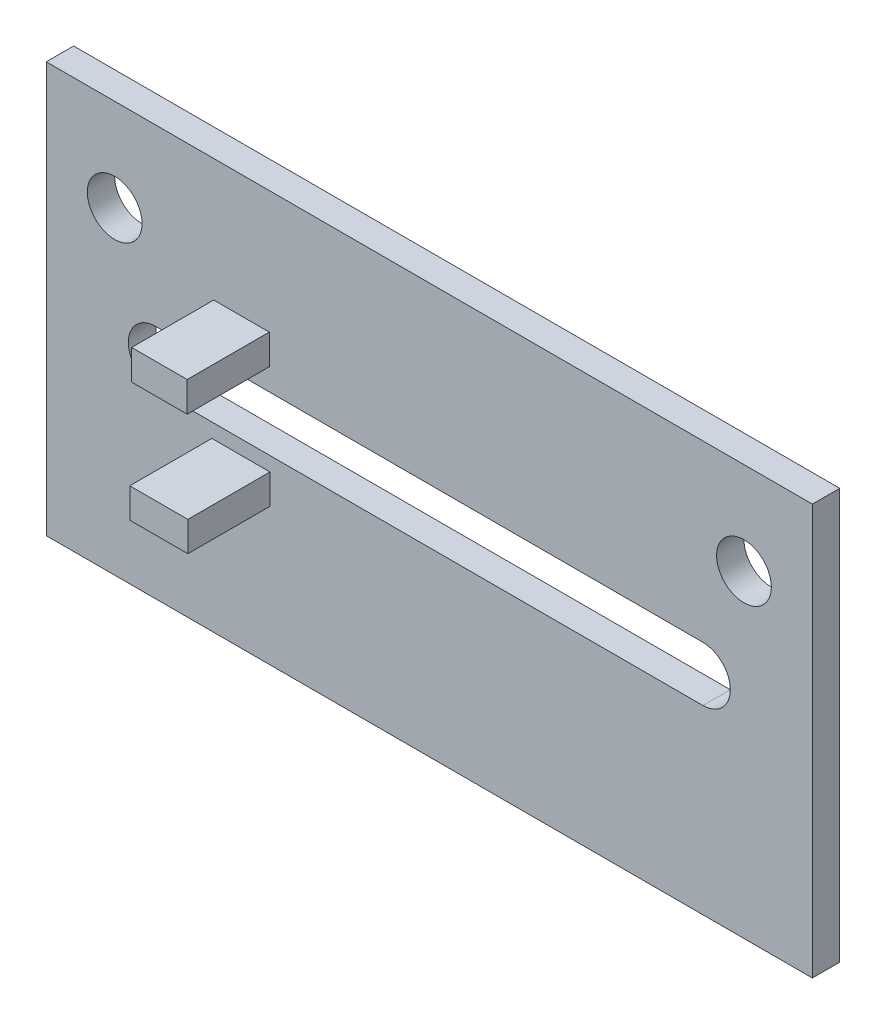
ISO-10303-21;
HEADER;
FILE_DESCRIPTION(('STEP AP214'),'2;1');
FILE_NAME('part.step','',(''),(''),'','','');
FILE_SCHEMA(('AUTOMOTIVE_DESIGN { 1 0 10303 214 1 1 1 1 }'));
ENDSEC;
DATA;
#1=APPLICATION_CONTEXT('core data for automotive mechanical design processes');
#2=APPLICATION_PROTOCOL_DEFINITION('international standard','automotive_design',2000,#1);
#3=PRODUCT_CONTEXT('',#1,'mechanical');
#4=PRODUCT('Part','Part','',(#3));
#5=PRODUCT_RELATED_PRODUCT_CATEGORY('part','',(#4));
#6=PRODUCT_DEFINITION_FORMATION('','',#4);
#7=PRODUCT_DEFINITION_CONTEXT('part definition',#1,'design');
#8=PRODUCT_DEFINITION('design','',#6,#7);
#9=PRODUCT_DEFINITION_SHAPE('','',#8);
#10=(LENGTH_UNIT() NAMED_UNIT(*) SI_UNIT(.MILLI.,.METRE.));
#11=(NAMED_UNIT(*) PLANE_ANGLE_UNIT() SI_UNIT($,.RADIAN.));
#12=(NAMED_UNIT(*) SI_UNIT($,.STERADIAN.) SOLID_ANGLE_UNIT());
#13=UNCERTAINTY_MEASURE_WITH_UNIT(LENGTH_MEASURE(1.E-05),#10,'distance_accuracy_value','');
#14=(GEOMETRIC_REPRESENTATION_CONTEXT(3) GLOBAL_UNCERTAINTY_ASSIGNED_CONTEXT((#13)) GLOBAL_UNIT_ASSIGNED_CONTEXT((#10,
#11,#12)) REPRESENTATION_CONTEXT('',''));
#15=CARTESIAN_POINT('',(0.,0.,0.));
#16=DIRECTION('',(0.,0.,1.));
#17=DIRECTION('',(1.,0.,0.));
#18=AXIS2_PLACEMENT_3D('',#15,#16,#17);
#19=CARTESIAN_POINT('',(0.,0.,1.));
#20=DIRECTION('',(0.,0.,-1.));
#21=DIRECTION('',(-1.,0.,0.));
#22=AXIS2_PLACEMENT_3D('',#19,#20,#21);
#23=PLANE('',#22);
#24=DIRECTION('',(0.,-1.,0.));
#25=VECTOR('',#24,1.);
#26=CARTESIAN_POINT('',(6.0514025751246,5.01732790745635,1.));
#27=LINE('',#26,#25);
#28=CARTESIAN_POINT('',(6.0514025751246,6.10483288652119,1.));
#29=VERTEX_POINT('',#28);
#30=CARTESIAN_POINT('',(6.0514025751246,5.01732790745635,1.));
#31=VERTEX_POINT('',#30);
#32=EDGE_CURVE('E169',#29,#31,#27,.T.);
#33=ORIENTED_EDGE('',*,*,#32,.F.);
#34=DIRECTION('',(-1.,0.,0.));
#35=VECTOR('',#34,1.);
#36=CARTESIAN_POINT('',(6.0514025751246,6.10483288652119,1.));
#37=LINE('',#36,#35);
#38=CARTESIAN_POINT('',(8.17504394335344,6.10483288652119,1.));
#39=VERTEX_POINT('',#38);
#40=EDGE_CURVE('E182',#39,#29,#37,.T.);
#41=ORIENTED_EDGE('',*,*,#40,.F.);
#42=DIRECTION('',(0.,1.,0.));
#43=VECTOR('',#42,1.);
#44=CARTESIAN_POINT('',(8.17504394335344,5.01732790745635,1.));
#45=LINE('',#44,#43);
#46=CARTESIAN_POINT('',(8.17504394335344,5.01732790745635,1.));
#47=VERTEX_POINT('',#46);
#48=EDGE_CURVE('E191',#47,#39,#45,.T.);
#49=ORIENTED_EDGE('',*,*,#48,.F.);
#50=DIRECTION('',(1.,0.,0.));
#51=VECTOR('',#50,1.);
#52=CARTESIAN_POINT('',(6.0514025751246,5.01732790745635,1.));
#53=LINE('',#52,#51);
#54=EDGE_CURVE('E172',#31,#47,#53,.T.);
#55=ORIENTED_EDGE('',*,*,#54,.F.);
#56=EDGE_LOOP('',(#33,#41,#49,#55));
#57=FACE_BOUND('',#56,.T.);
#58=CARTESIAN_POINT('',(25.5,11.6253947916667,1.));
#59=DIRECTION('',(0.,0.,1.));
#60=DIRECTION('',(1.,0.,0.));
#61=AXIS2_PLACEMENT_3D('',#58,#59,#60);
#62=CIRCLE('',#61,1.);
#63=CARTESIAN_POINT('',(26.5,11.6253947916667,1.));
#64=VERTEX_POINT('',#63);
#65=EDGE_CURVE('E239',#64,#64,#62,.T.);
#66=ORIENTED_EDGE('',*,*,#65,.F.);
#67=EDGE_LOOP('',(#66));
#68=FACE_BOUND('',#67,.T.);
#69=DIRECTION('',(0.,-1.,0.));
#70=VECTOR('',#69,1.);
#71=CARTESIAN_POINT('',(0.,0.,1.));
#72=LINE('',#71,#70);
#73=CARTESIAN_POINT('',(0.,15.,1.));
#74=VERTEX_POINT('',#73);
#75=CARTESIAN_POINT('',(0.,0.,1.));
#76=VERTEX_POINT('',#75);
#77=EDGE_CURVE('E251',#74,#76,#72,.T.);
#78=ORIENTED_EDGE('',*,*,#77,.T.);
#79=DIRECTION('',(1.,0.,0.));
#80=VECTOR('',#79,1.);
#81=CARTESIAN_POINT('',(0.,0.,1.));
#82=LINE('',#81,#80);
#83=CARTESIAN_POINT('',(28.,0.,1.));
#84=VERTEX_POINT('',#83);
#85=EDGE_CURVE('E254',#76,#84,#82,.T.);
#86=ORIENTED_EDGE('',*,*,#85,.T.);
#87=DIRECTION('',(0.,1.,0.));
#88=VECTOR('',#87,1.);
#89=CARTESIAN_POINT('',(28.,0.,1.));
#90=LINE('',#89,#88);
#91=CARTESIAN_POINT('',(28.,15.,1.));
#92=VERTEX_POINT('',#91);
#93=EDGE_CURVE('E257',#84,#92,#90,.T.);
#94=ORIENTED_EDGE('',*,*,#93,.T.);
#95=DIRECTION('',(-1.,0.,0.));
#96=VECTOR('',#95,1.);
#97=CARTESIAN_POINT('',(0.,15.,1.));
#98=LINE('',#97,#96);
#99=EDGE_CURVE('E259',#92,#74,#98,.T.);
#100=ORIENTED_EDGE('',*,*,#99,.T.);
#101=EDGE_LOOP('',(#78,#86,#94,#100));
#102=FACE_BOUND('',#101,.T.);
#103=CARTESIAN_POINT('',(2.5,11.6253947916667,1.));
#104=DIRECTION('',(0.,0.,1.));
#105=DIRECTION('',(1.,0.,0.));
#106=AXIS2_PLACEMENT_3D('',#103,#104,#105);
#107=CIRCLE('',#106,1.);
#108=CARTESIAN_POINT('',(3.5,11.6253947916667,1.));
#109=VERTEX_POINT('',#108);
#110=EDGE_CURVE('E245',#109,#109,#107,.T.);
#111=ORIENTED_EDGE('',*,*,#110,.F.);
#112=EDGE_LOOP('',(#111));
#113=FACE_BOUND('',#112,.T.);
#114=CARTESIAN_POINT('',(4.,7.62539479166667,1.));
#115=DIRECTION('',(0.,0.,1.));
#116=DIRECTION('',(1.,0.,0.));
#117=AXIS2_PLACEMENT_3D('',#114,#115,#116);
#118=CIRCLE('',#117,1.);
#119=CARTESIAN_POINT('',(4.,8.62539479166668,1.));
#120=VERTEX_POINT('',#119);
#121=CARTESIAN_POINT('',(4.,6.62539479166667,1.));
#122=VERTEX_POINT('',#121);
#123=EDGE_CURVE('E208',#120,#122,#118,.T.);
#124=ORIENTED_EDGE('',*,*,#123,.F.);
#125=DIRECTION('',(-1.,0.,0.));
#126=VECTOR('',#125,1.);
#127=CARTESIAN_POINT('',(4.,8.62539479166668,1.));
#128=LINE('',#127,#126);
#129=CARTESIAN_POINT('',(24.,8.62539479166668,1.));
#130=VERTEX_POINT('',#129);
#131=EDGE_CURVE('E216',#130,#120,#128,.T.);
#132=ORIENTED_EDGE('',*,*,#131,.F.);
#133=CARTESIAN_POINT('',(24.,7.62539479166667,1.));
#134=DIRECTION('',(0.,0.,1.));
#135=DIRECTION('',(1.,0.,0.));
#136=AXIS2_PLACEMENT_3D('',#133,#134,#135);
#137=CIRCLE('',#136,1.);
#138=CARTESIAN_POINT('',(24.,6.62539479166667,1.));
#139=VERTEX_POINT('',#138);
#140=EDGE_CURVE('E213',#139,#130,#137,.T.);
#141=ORIENTED_EDGE('',*,*,#140,.F.);
#142=DIRECTION('',(1.,0.,0.));
#143=VECTOR('',#142,1.);
#144=CARTESIAN_POINT('',(24.,6.62539479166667,1.));
#145=LINE('',#144,#143);
#146=EDGE_CURVE('E210',#122,#139,#145,.T.);
#147=ORIENTED_EDGE('',*,*,#146,.F.);
#148=EDGE_LOOP('',(#124,#132,#141,#147));
#149=FACE_BOUND('',#148,.T.);
#150=DIRECTION('',(0.,-1.,0.));
#151=VECTOR('',#150,1.);
#152=CARTESIAN_POINT('',(6.11963402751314,10.5188630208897,1.));
#153=LINE('',#152,#151);
#154=CARTESIAN_POINT('',(6.11963402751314,10.5188630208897,1.));
#155=VERTEX_POINT('',#154);
#156=CARTESIAN_POINT('',(6.11963402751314,9.42092674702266,1.));
#157=VERTEX_POINT('',#156);
#158=EDGE_CURVE('E168',#155,#157,#153,.T.);
#159=ORIENTED_EDGE('',*,*,#158,.F.);
#160=DIRECTION('',(-1.,0.,0.));
#161=VECTOR('',#160,1.);
#162=CARTESIAN_POINT('',(6.11963402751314,10.5188630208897,1.));
#163=LINE('',#162,#161);
#164=CARTESIAN_POINT('',(8.14970860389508,10.5188630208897,1.));
#165=VERTEX_POINT('',#164);
#166=EDGE_CURVE('E165',#165,#155,#163,.T.);
#167=ORIENTED_EDGE('',*,*,#166,.F.);
#168=DIRECTION('',(0.,1.,0.));
#169=VECTOR('',#168,1.);
#170=CARTESIAN_POINT('',(8.14970860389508,10.5188630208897,1.));
#171=LINE('',#170,#169);
#172=CARTESIAN_POINT('',(8.14970860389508,9.42092674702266,1.));
#173=VERTEX_POINT('',#172);
#174=EDGE_CURVE('E55',#173,#165,#171,.T.);
#175=ORIENTED_EDGE('',*,*,#174,.F.);
#176=DIRECTION('',(1.,0.,0.));
#177=VECTOR('',#176,1.);
#178=CARTESIAN_POINT('',(6.11963402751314,9.42092674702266,1.));
#179=LINE('',#178,#177);
#180=EDGE_CURVE('E50',#157,#173,#179,.T.);
#181=ORIENTED_EDGE('',*,*,#180,.F.);
#182=EDGE_LOOP('',(#159,#167,#175,#181));
#183=FACE_BOUND('',#182,.T.);
#184=ADVANCED_FACE('F35',(#57,#68,#102,#113,#149,#183),#23,.F.);
#185=CARTESIAN_POINT('',(0.,0.,0.));
#186=DIRECTION('',(0.,0.,-1.));
#187=DIRECTION('',(-1.,0.,0.));
#188=AXIS2_PLACEMENT_3D('',#185,#186,#187);
#189=PLANE('',#188);
#190=CARTESIAN_POINT('',(25.5,11.6253947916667,0.));
#191=DIRECTION('',(0.,0.,1.));
#192=DIRECTION('',(1.,0.,0.));
#193=AXIS2_PLACEMENT_3D('',#190,#191,#192);
#194=CIRCLE('',#193,1.);
#195=CARTESIAN_POINT('',(26.5,11.6253947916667,0.));
#196=VERTEX_POINT('',#195);
#197=EDGE_CURVE('E238',#196,#196,#194,.T.);
#198=ORIENTED_EDGE('',*,*,#197,.T.);
#199=EDGE_LOOP('',(#198));
#200=FACE_BOUND('',#199,.T.);
#201=DIRECTION('',(0.,-1.,0.));
#202=VECTOR('',#201,1.);
#203=CARTESIAN_POINT('',(0.,0.,0.));
#204=LINE('',#203,#202);
#205=CARTESIAN_POINT('',(0.,15.,0.));
#206=VERTEX_POINT('',#205);
#207=CARTESIAN_POINT('',(0.,0.,0.));
#208=VERTEX_POINT('',#207);
#209=EDGE_CURVE('E248',#206,#208,#204,.T.);
#210=ORIENTED_EDGE('',*,*,#209,.F.);
#211=DIRECTION('',(-1.,0.,0.));
#212=VECTOR('',#211,1.);
#213=CARTESIAN_POINT('',(0.,15.,0.));
#214=LINE('',#213,#212);
#215=CARTESIAN_POINT('',(28.,15.,0.));
#216=VERTEX_POINT('',#215);
#217=EDGE_CURVE('E255',#216,#206,#214,.T.);
#218=ORIENTED_EDGE('',*,*,#217,.F.);
#219=DIRECTION('',(0.,1.,0.));
#220=VECTOR('',#219,1.);
#221=CARTESIAN_POINT('',(28.,0.,0.));
#222=LINE('',#221,#220);
#223=CARTESIAN_POINT('',(28.,0.,0.));
#224=VERTEX_POINT('',#223);
#225=EDGE_CURVE('E266',#224,#216,#222,.T.);
#226=ORIENTED_EDGE('',*,*,#225,.F.);
#227=DIRECTION('',(1.,0.,0.));
#228=VECTOR('',#227,1.);
#229=CARTESIAN_POINT('',(0.,0.,0.));
#230=LINE('',#229,#228);
#231=EDGE_CURVE('E264',#208,#224,#230,.T.);
#232=ORIENTED_EDGE('',*,*,#231,.F.);
#233=EDGE_LOOP('',(#210,#218,#226,#232));
#234=FACE_BOUND('',#233,.T.);
#235=CARTESIAN_POINT('',(2.5,11.6253947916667,0.));
#236=DIRECTION('',(0.,0.,1.));
#237=DIRECTION('',(1.,0.,0.));
#238=AXIS2_PLACEMENT_3D('',#235,#236,#237);
#239=CIRCLE('',#238,1.);
#240=CARTESIAN_POINT('',(3.5,11.6253947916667,0.));
#241=VERTEX_POINT('',#240);
#242=EDGE_CURVE('E242',#241,#241,#239,.T.);
#243=ORIENTED_EDGE('',*,*,#242,.T.);
#244=EDGE_LOOP('',(#243));
#245=FACE_BOUND('',#244,.T.);
#246=DIRECTION('',(-1.,0.,0.));
#247=VECTOR('',#246,1.);
#248=CARTESIAN_POINT('',(4.,8.62539479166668,0.));
#249=LINE('',#248,#247);
#250=CARTESIAN_POINT('',(24.,8.62539479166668,0.));
#251=VERTEX_POINT('',#250);
#252=CARTESIAN_POINT('',(4.,8.62539479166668,0.));
#253=VERTEX_POINT('',#252);
#254=EDGE_CURVE('E211',#251,#253,#249,.T.);
#255=ORIENTED_EDGE('',*,*,#254,.T.);
#256=CARTESIAN_POINT('',(4.,7.62539479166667,0.));
#257=DIRECTION('',(0.,0.,1.));
#258=DIRECTION('',(1.,0.,0.));
#259=AXIS2_PLACEMENT_3D('',#256,#257,#258);
#260=CIRCLE('',#259,1.);
#261=CARTESIAN_POINT('',(4.,6.62539479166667,0.));
#262=VERTEX_POINT('',#261);
#263=EDGE_CURVE('E207',#253,#262,#260,.T.);
#264=ORIENTED_EDGE('',*,*,#263,.T.);
#265=DIRECTION('',(1.,0.,0.));
#266=VECTOR('',#265,1.);
#267=CARTESIAN_POINT('',(24.,6.62539479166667,0.));
#268=LINE('',#267,#266);
#269=CARTESIAN_POINT('',(24.,6.62539479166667,0.));
#270=VERTEX_POINT('',#269);
#271=EDGE_CURVE('E221',#262,#270,#268,.T.);
#272=ORIENTED_EDGE('',*,*,#271,.T.);
#273=CARTESIAN_POINT('',(24.,7.62539479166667,0.));
#274=DIRECTION('',(0.,0.,1.));
#275=DIRECTION('',(1.,0.,0.));
#276=AXIS2_PLACEMENT_3D('',#273,#274,#275);
#277=CIRCLE('',#276,1.);
#278=EDGE_CURVE('E224',#270,#251,#277,.T.);
#279=ORIENTED_EDGE('',*,*,#278,.T.);
#280=EDGE_LOOP('',(#255,#264,#272,#279));
#281=FACE_BOUND('',#280,.T.);
#282=ADVANCED_FACE('F284',(#200,#234,#245,#281),#189,.T.);
#283=CARTESIAN_POINT('',(0.,0.,1.));
#284=DIRECTION('',(1.,0.,0.));
#285=DIRECTION('',(0.,0.,-1.));
#286=AXIS2_PLACEMENT_3D('',#283,#284,#285);
#287=PLANE('',#286);
#288=ORIENTED_EDGE('',*,*,#209,.T.);
#289=DIRECTION('',(0.,0.,-1.));
#290=VECTOR('',#289,1.);
#291=CARTESIAN_POINT('',(0.,0.,1.));
#292=LINE('',#291,#290);
#293=EDGE_CURVE('E11',#76,#208,#292,.T.);
#294=ORIENTED_EDGE('',*,*,#293,.F.);
#295=ORIENTED_EDGE('',*,*,#77,.F.);
#296=DIRECTION('',(0.,0.,-1.));
#297=VECTOR('',#296,1.);
#298=CARTESIAN_POINT('',(0.,15.,1.));
#299=LINE('',#298,#297);
#300=EDGE_CURVE('E261',#74,#206,#299,.T.);
#301=ORIENTED_EDGE('',*,*,#300,.T.);
#302=EDGE_LOOP('',(#288,#294,#295,#301));
#303=FACE_BOUND('',#302,.T.);
#304=ADVANCED_FACE('F37',(#303),#287,.F.);
#305=CARTESIAN_POINT('',(0.,0.,1.));
#306=DIRECTION('',(0.,1.,0.));
#307=DIRECTION('',(0.,0.,1.));
#308=AXIS2_PLACEMENT_3D('',#305,#306,#307);
#309=PLANE('',#308);
#310=ORIENTED_EDGE('',*,*,#231,.T.);
#311=DIRECTION('',(0.,0.,-1.));
#312=VECTOR('',#311,1.);
#313=CARTESIAN_POINT('',(28.,0.,1.));
#314=LINE('',#313,#312);
#315=EDGE_CURVE('E43',#84,#224,#314,.T.);
#316=ORIENTED_EDGE('',*,*,#315,.F.);
#317=ORIENTED_EDGE('',*,*,#85,.F.);
#318=ORIENTED_EDGE('',*,*,#293,.T.);
#319=EDGE_LOOP('',(#310,#316,#317,#318));
#320=FACE_BOUND('',#319,.T.);
#321=ADVANCED_FACE('F295',(#320),#309,.F.);
#322=CARTESIAN_POINT('',(28.,0.,1.));
#323=DIRECTION('',(-1.,0.,0.));
#324=DIRECTION('',(0.,-1.,0.));
#325=AXIS2_PLACEMENT_3D('',#322,#323,#324);
#326=PLANE('',#325);
#327=ORIENTED_EDGE('',*,*,#225,.T.);
#328=DIRECTION('',(0.,0.,-1.));
#329=VECTOR('',#328,1.);
#330=CARTESIAN_POINT('',(28.,15.,1.));
#331=LINE('',#330,#329);
#332=EDGE_CURVE('E271',#92,#216,#331,.T.);
#333=ORIENTED_EDGE('',*,*,#332,.F.);
#334=ORIENTED_EDGE('',*,*,#93,.F.);
#335=ORIENTED_EDGE('',*,*,#315,.T.);
#336=EDGE_LOOP('',(#327,#333,#334,#335));
#337=FACE_BOUND('',#336,.T.);
#338=ADVANCED_FACE('F278',(#337),#326,.F.);
#339=CARTESIAN_POINT('',(0.,15.,1.));
#340=DIRECTION('',(0.,-1.,0.));
#341=DIRECTION('',(0.,0.,-1.));
#342=AXIS2_PLACEMENT_3D('',#339,#340,#341);
#343=PLANE('',#342);
#344=ORIENTED_EDGE('',*,*,#217,.T.);
#345=ORIENTED_EDGE('',*,*,#300,.F.);
#346=ORIENTED_EDGE('',*,*,#99,.F.);
#347=ORIENTED_EDGE('',*,*,#332,.T.);
#348=EDGE_LOOP('',(#344,#345,#346,#347));
#349=FACE_BOUND('',#348,.T.);
#350=ADVANCED_FACE('F288',(#349),#343,.F.);
#351=CARTESIAN_POINT('',(2.5,11.6253947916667,1.));
#352=DIRECTION('',(0.,0.,-1.));
#353=DIRECTION('',(-1.,0.,0.));
#354=AXIS2_PLACEMENT_3D('',#351,#352,#353);
#355=CYLINDRICAL_SURFACE('',#354,1.);
#356=ORIENTED_EDGE('',*,*,#110,.T.);
#357=EDGE_LOOP('',(#356));
#358=FACE_BOUND('',#357,.T.);
#359=ORIENTED_EDGE('',*,*,#242,.F.);
#360=EDGE_LOOP('',(#359));
#361=FACE_BOUND('',#360,.T.);
#362=ADVANCED_FACE('F312',(#358,#361),#355,.F.);
#363=CARTESIAN_POINT('',(25.5,11.6253947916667,1.));
#364=DIRECTION('',(0.,0.,-1.));
#365=DIRECTION('',(-1.,0.,0.));
#366=AXIS2_PLACEMENT_3D('',#363,#364,#365);
#367=CYLINDRICAL_SURFACE('',#366,1.);
#368=ORIENTED_EDGE('',*,*,#65,.T.);
#369=EDGE_LOOP('',(#368));
#370=FACE_BOUND('',#369,.T.);
#371=ORIENTED_EDGE('',*,*,#197,.F.);
#372=EDGE_LOOP('',(#371));
#373=FACE_BOUND('',#372,.T.);
#374=ADVANCED_FACE('F319',(#370,#373),#367,.F.);
#375=CARTESIAN_POINT('',(4.,7.62539479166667,1.));
#376=DIRECTION('',(0.,0.,-1.));
#377=DIRECTION('',(-1.,0.,0.));
#378=AXIS2_PLACEMENT_3D('',#375,#376,#377);
#379=CYLINDRICAL_SURFACE('',#378,1.);
#380=ORIENTED_EDGE('',*,*,#263,.F.);
#381=DIRECTION('',(0.,0.,-1.));
#382=VECTOR('',#381,1.);
#383=CARTESIAN_POINT('',(4.,8.62539479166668,1.));
#384=LINE('',#383,#382);
#385=EDGE_CURVE('E218',#120,#253,#384,.T.);
#386=ORIENTED_EDGE('',*,*,#385,.F.);
#387=ORIENTED_EDGE('',*,*,#123,.T.);
#388=DIRECTION('',(0.,0.,-1.));
#389=VECTOR('',#388,1.);
#390=CARTESIAN_POINT('',(4.,6.62539479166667,1.));
#391=LINE('',#390,#389);
#392=EDGE_CURVE('E235',#122,#262,#391,.T.);
#393=ORIENTED_EDGE('',*,*,#392,.T.);
#394=EDGE_LOOP('',(#380,#386,#387,#393));
#395=FACE_BOUND('',#394,.T.);
#396=ADVANCED_FACE('F324',(#395),#379,.F.);
#397=CARTESIAN_POINT('',(24.,6.62539479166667,1.));
#398=DIRECTION('',(0.,1.,0.));
#399=DIRECTION('',(-1.,0.,0.));
#400=AXIS2_PLACEMENT_3D('',#397,#398,#399);
#401=PLANE('',#400);
#402=ORIENTED_EDGE('',*,*,#271,.F.);
#403=ORIENTED_EDGE('',*,*,#392,.F.);
#404=ORIENTED_EDGE('',*,*,#146,.T.);
#405=DIRECTION('',(0.,0.,-1.));
#406=VECTOR('',#405,1.);
#407=CARTESIAN_POINT('',(24.,6.62539479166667,1.));
#408=LINE('',#407,#406);
#409=EDGE_CURVE('E233',#139,#270,#408,.T.);
#410=ORIENTED_EDGE('',*,*,#409,.T.);
#411=EDGE_LOOP('',(#402,#403,#404,#410));
#412=FACE_BOUND('',#411,.T.);
#413=ADVANCED_FACE('F344',(#412),#401,.T.);
#414=CARTESIAN_POINT('',(24.,7.62539479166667,1.));
#415=DIRECTION('',(0.,0.,-1.));
#416=DIRECTION('',(-1.,0.,0.));
#417=AXIS2_PLACEMENT_3D('',#414,#415,#416);
#418=CYLINDRICAL_SURFACE('',#417,1.);
#419=ORIENTED_EDGE('',*,*,#278,.F.);
#420=ORIENTED_EDGE('',*,*,#409,.F.);
#421=ORIENTED_EDGE('',*,*,#140,.T.);
#422=DIRECTION('',(0.,0.,-1.));
#423=VECTOR('',#422,1.);
#424=CARTESIAN_POINT('',(24.,8.62539479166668,1.));
#425=LINE('',#424,#423);
#426=EDGE_CURVE('E231',#130,#251,#425,.T.);
#427=ORIENTED_EDGE('',*,*,#426,.T.);
#428=EDGE_LOOP('',(#419,#420,#421,#427));
#429=FACE_BOUND('',#428,.T.);
#430=ADVANCED_FACE('F346',(#429),#418,.F.);
#431=CARTESIAN_POINT('',(4.,8.62539479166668,1.));
#432=DIRECTION('',(0.,-1.,0.));
#433=DIRECTION('',(0.,0.,-1.));
#434=AXIS2_PLACEMENT_3D('',#431,#432,#433);
#435=PLANE('',#434);
#436=ORIENTED_EDGE('',*,*,#254,.F.);
#437=ORIENTED_EDGE('',*,*,#426,.F.);
#438=ORIENTED_EDGE('',*,*,#131,.T.);
#439=ORIENTED_EDGE('',*,*,#385,.T.);
#440=EDGE_LOOP('',(#436,#437,#438,#439));
#441=FACE_BOUND('',#440,.T.);
#442=ADVANCED_FACE('F333',(#441),#435,.T.);
#443=CARTESIAN_POINT('',(6.0514025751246,5.01732790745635,4.));
#444=DIRECTION('',(1.,0.,0.));
#445=DIRECTION('',(0.,0.,-1.));
#446=AXIS2_PLACEMENT_3D('',#443,#444,#445);
#447=PLANE('',#446);
#448=ORIENTED_EDGE('',*,*,#32,.T.);
#449=DIRECTION('',(0.,0.,-1.));
#450=VECTOR('',#449,1.);
#451=CARTESIAN_POINT('',(6.0514025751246,5.01732790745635,4.));
#452=LINE('',#451,#450);
#453=CARTESIAN_POINT('',(6.0514025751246,5.01732790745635,4.));
#454=VERTEX_POINT('',#453);
#455=EDGE_CURVE('E204',#454,#31,#452,.T.);
#456=ORIENTED_EDGE('',*,*,#455,.F.);
#457=DIRECTION('',(0.,-1.,0.));
#458=VECTOR('',#457,1.);
#459=CARTESIAN_POINT('',(6.0514025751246,5.01732790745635,4.));
#460=LINE('',#459,#458);
#461=CARTESIAN_POINT('',(6.0514025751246,6.10483288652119,4.));
#462=VERTEX_POINT('',#461);
#463=EDGE_CURVE('E178',#462,#454,#460,.T.);
#464=ORIENTED_EDGE('',*,*,#463,.F.);
#465=DIRECTION('',(0.,0.,-1.));
#466=VECTOR('',#465,1.);
#467=CARTESIAN_POINT('',(6.0514025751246,6.10483288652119,4.));
#468=LINE('',#467,#466);
#469=EDGE_CURVE('E187',#462,#29,#468,.T.);
#470=ORIENTED_EDGE('',*,*,#469,.T.);
#471=EDGE_LOOP('',(#448,#456,#464,#470));
#472=FACE_BOUND('',#471,.T.);
#473=ADVANCED_FACE('F353',(#472),#447,.F.);
#474=CARTESIAN_POINT('',(6.0514025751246,5.01732790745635,4.));
#475=DIRECTION('',(0.,1.,0.));
#476=DIRECTION('',(0.,0.,1.));
#477=AXIS2_PLACEMENT_3D('',#474,#475,#476);
#478=PLANE('',#477);
#479=ORIENTED_EDGE('',*,*,#54,.T.);
#480=DIRECTION('',(0.,0.,-1.));
#481=VECTOR('',#480,1.);
#482=CARTESIAN_POINT('',(8.17504394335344,5.01732790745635,4.));
#483=LINE('',#482,#481);
#484=CARTESIAN_POINT('',(8.17504394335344,5.01732790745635,4.));
#485=VERTEX_POINT('',#484);
#486=EDGE_CURVE('E201',#485,#47,#483,.T.);
#487=ORIENTED_EDGE('',*,*,#486,.F.);
#488=DIRECTION('',(1.,0.,0.));
#489=VECTOR('',#488,1.);
#490=CARTESIAN_POINT('',(6.0514025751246,5.01732790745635,4.));
#491=LINE('',#490,#489);
#492=EDGE_CURVE('E181',#454,#485,#491,.T.);
#493=ORIENTED_EDGE('',*,*,#492,.F.);
#494=ORIENTED_EDGE('',*,*,#455,.T.);
#495=EDGE_LOOP('',(#479,#487,#493,#494));
#496=FACE_BOUND('',#495,.T.);
#497=ADVANCED_FACE('F390',(#496),#478,.F.);
#498=CARTESIAN_POINT('',(8.17504394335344,5.01732790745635,4.));
#499=DIRECTION('',(-1.,0.,0.));
#500=DIRECTION('',(0.,0.,1.));
#501=AXIS2_PLACEMENT_3D('',#498,#499,#500);
#502=PLANE('',#501);
#503=ORIENTED_EDGE('',*,*,#48,.T.);
#504=DIRECTION('',(0.,0.,-1.));
#505=VECTOR('',#504,1.);
#506=CARTESIAN_POINT('',(8.17504394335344,6.10483288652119,4.));
#507=LINE('',#506,#505);
#508=CARTESIAN_POINT('',(8.17504394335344,6.10483288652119,4.));
#509=VERTEX_POINT('',#508);
#510=EDGE_CURVE('E198',#509,#39,#507,.T.);
#511=ORIENTED_EDGE('',*,*,#510,.F.);
#512=DIRECTION('',(0.,1.,0.));
#513=VECTOR('',#512,1.);
#514=CARTESIAN_POINT('',(8.17504394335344,5.01732790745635,4.));
#515=LINE('',#514,#513);
#516=EDGE_CURVE('E184',#485,#509,#515,.T.);
#517=ORIENTED_EDGE('',*,*,#516,.F.);
#518=ORIENTED_EDGE('',*,*,#486,.T.);
#519=EDGE_LOOP('',(#503,#511,#517,#518));
#520=FACE_BOUND('',#519,.T.);
#521=ADVANCED_FACE('F399',(#520),#502,.F.);
#522=CARTESIAN_POINT('',(6.0514025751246,6.10483288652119,4.));
#523=DIRECTION('',(0.,-1.,0.));
#524=DIRECTION('',(0.,0.,-1.));
#525=AXIS2_PLACEMENT_3D('',#522,#523,#524);
#526=PLANE('',#525);
#527=ORIENTED_EDGE('',*,*,#40,.T.);
#528=ORIENTED_EDGE('',*,*,#469,.F.);
#529=DIRECTION('',(-1.,0.,0.));
#530=VECTOR('',#529,1.);
#531=CARTESIAN_POINT('',(6.0514025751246,6.10483288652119,4.));
#532=LINE('',#531,#530);
#533=EDGE_CURVE('E186',#509,#462,#532,.T.);
#534=ORIENTED_EDGE('',*,*,#533,.F.);
#535=ORIENTED_EDGE('',*,*,#510,.T.);
#536=EDGE_LOOP('',(#527,#528,#534,#535));
#537=FACE_BOUND('',#536,.T.);
#538=ADVANCED_FACE('F409',(#537),#526,.F.);
#539=CARTESIAN_POINT('',(0.,0.,4.));
#540=DIRECTION('',(0.,0.,-1.));
#541=DIRECTION('',(-1.,0.,0.));
#542=AXIS2_PLACEMENT_3D('',#539,#540,#541);
#543=PLANE('',#542);
#544=ORIENTED_EDGE('',*,*,#463,.T.);
#545=ORIENTED_EDGE('',*,*,#492,.T.);
#546=ORIENTED_EDGE('',*,*,#516,.T.);
#547=ORIENTED_EDGE('',*,*,#533,.T.);
#548=EDGE_LOOP('',(#544,#545,#546,#547));
#549=FACE_BOUND('',#548,.T.);
#550=ADVANCED_FACE('F419',(#549),#543,.F.);
#551=CARTESIAN_POINT('',(6.11963402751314,10.5188630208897,4.));
#552=DIRECTION('',(1.,0.,0.));
#553=DIRECTION('',(0.,0.,-1.));
#554=AXIS2_PLACEMENT_3D('',#551,#552,#553);
#555=PLANE('',#554);
#556=ORIENTED_EDGE('',*,*,#158,.T.);
#557=DIRECTION('',(0.,0.,-1.));
#558=VECTOR('',#557,1.);
#559=CARTESIAN_POINT('',(6.11963402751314,9.42092674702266,4.));
#560=LINE('',#559,#558);
#561=CARTESIAN_POINT('',(6.11963402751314,9.42092674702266,4.));
#562=VERTEX_POINT('',#561);
#563=EDGE_CURVE('E149',#562,#157,#560,.T.);
#564=ORIENTED_EDGE('',*,*,#563,.F.);
#565=DIRECTION('',(0.,-1.,0.));
#566=VECTOR('',#565,1.);
#567=CARTESIAN_POINT('',(6.11963402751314,10.5188630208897,4.));
#568=LINE('',#567,#566);
#569=CARTESIAN_POINT('',(6.11963402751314,10.5188630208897,4.));
#570=VERTEX_POINT('',#569);
#571=EDGE_CURVE('E156',#570,#562,#568,.T.);
#572=ORIENTED_EDGE('',*,*,#571,.F.);
#573=DIRECTION('',(0.,0.,-1.));
#574=VECTOR('',#573,1.);
#575=CARTESIAN_POINT('',(6.11963402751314,10.5188630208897,4.));
#576=LINE('',#575,#574);
#577=EDGE_CURVE('E479',#570,#155,#576,.T.);
#578=ORIENTED_EDGE('',*,*,#577,.T.);
#579=EDGE_LOOP('',(#556,#564,#572,#578));
#580=FACE_BOUND('',#579,.T.);
#581=ADVANCED_FACE('F167',(#580),#555,.F.);
#582=CARTESIAN_POINT('',(6.11963402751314,9.42092674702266,4.));
#583=DIRECTION('',(0.,1.,0.));
#584=DIRECTION('',(0.,0.,1.));
#585=AXIS2_PLACEMENT_3D('',#582,#583,#584);
#586=PLANE('',#585);
#587=ORIENTED_EDGE('',*,*,#180,.T.);
#588=DIRECTION('',(0.,0.,-1.));
#589=VECTOR('',#588,1.);
#590=CARTESIAN_POINT('',(8.14970860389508,9.42092674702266,4.));
#591=LINE('',#590,#589);
#592=CARTESIAN_POINT('',(8.14970860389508,9.42092674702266,4.));
#593=VERTEX_POINT('',#592);
#594=EDGE_CURVE('E152',#593,#173,#591,.T.);
#595=ORIENTED_EDGE('',*,*,#594,.F.);
#596=DIRECTION('',(1.,0.,0.));
#597=VECTOR('',#596,1.);
#598=CARTESIAN_POINT('',(6.11963402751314,9.42092674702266,4.));
#599=LINE('',#598,#597);
#600=EDGE_CURVE('E145',#562,#593,#599,.T.);
#601=ORIENTED_EDGE('',*,*,#600,.F.);
#602=ORIENTED_EDGE('',*,*,#563,.T.);
#603=EDGE_LOOP('',(#587,#595,#601,#602));
#604=FACE_BOUND('',#603,.T.);
#605=ADVANCED_FACE('F147',(#604),#586,.F.);
#606=CARTESIAN_POINT('',(8.14970860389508,10.5188630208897,4.));
#607=DIRECTION('',(-1.,0.,0.));
#608=DIRECTION('',(0.,0.,1.));
#609=AXIS2_PLACEMENT_3D('',#606,#607,#608);
#610=PLANE('',#609);
#611=ORIENTED_EDGE('',*,*,#174,.T.);
#612=DIRECTION('',(0.,0.,-1.));
#613=VECTOR('',#612,1.);
#614=CARTESIAN_POINT('',(8.14970860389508,10.5188630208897,4.));
#615=LINE('',#614,#613);
#616=CARTESIAN_POINT('',(8.14970860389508,10.5188630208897,4.));
#617=VERTEX_POINT('',#616);
#618=EDGE_CURVE('E174',#617,#165,#615,.T.);
#619=ORIENTED_EDGE('',*,*,#618,.F.);
#620=DIRECTION('',(0.,1.,0.));
#621=VECTOR('',#620,1.);
#622=CARTESIAN_POINT('',(8.14970860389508,10.5188630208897,4.));
#623=LINE('',#622,#621);
#624=EDGE_CURVE('E155',#593,#617,#623,.T.);
#625=ORIENTED_EDGE('',*,*,#624,.F.);
#626=ORIENTED_EDGE('',*,*,#594,.T.);
#627=EDGE_LOOP('',(#611,#619,#625,#626));
#628=FACE_BOUND('',#627,.T.);
#629=ADVANCED_FACE('F446',(#628),#610,.F.);
#630=CARTESIAN_POINT('',(6.11963402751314,10.5188630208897,4.));
#631=DIRECTION('',(0.,-1.,0.));
#632=DIRECTION('',(0.,0.,-1.));
#633=AXIS2_PLACEMENT_3D('',#630,#631,#632);
#634=PLANE('',#633);
#635=ORIENTED_EDGE('',*,*,#166,.T.);
#636=ORIENTED_EDGE('',*,*,#577,.F.);
#637=DIRECTION('',(-1.,0.,0.));
#638=VECTOR('',#637,1.);
#639=CARTESIAN_POINT('',(6.11963402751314,10.5188630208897,4.));
#640=LINE('',#639,#638);
#641=EDGE_CURVE('E161',#617,#570,#640,.T.);
#642=ORIENTED_EDGE('',*,*,#641,.F.);
#643=ORIENTED_EDGE('',*,*,#618,.T.);
#644=EDGE_LOOP('',(#635,#636,#642,#643));
#645=FACE_BOUND('',#644,.T.);
#646=ADVANCED_FACE('F455',(#645),#634,.F.);
#647=CARTESIAN_POINT('',(0.,0.,4.));
#648=DIRECTION('',(0.,0.,1.));
#649=DIRECTION('',(1.,0.,0.));
#650=AXIS2_PLACEMENT_3D('',#647,#648,#649);
#651=PLANE('',#650);
#652=ORIENTED_EDGE('',*,*,#571,.T.);
#653=ORIENTED_EDGE('',*,*,#600,.T.);
#654=ORIENTED_EDGE('',*,*,#624,.T.);
#655=ORIENTED_EDGE('',*,*,#641,.T.);
#656=EDGE_LOOP('',(#652,#653,#654,#655));
#657=FACE_BOUND('',#656,.T.);
#658=ADVANCED_FACE('F159',(#657),#651,.T.);
#659=CLOSED_SHELL('',(#184,#282,#304,#321,#338,#350,#362,#374,#396,#413,#430,#442,#473,#497,
#521,#538,#550,#581,#605,#629,#646,#658));
#660=MANIFOLD_SOLID_BREP('B2',#659);
#661=ADVANCED_BREP_SHAPE_REPRESENTATION('',(#18,#660),#14);
#662=SHAPE_DEFINITION_REPRESENTATION(#9,#661);
ENDSEC;
END-ISO-10303-21;
